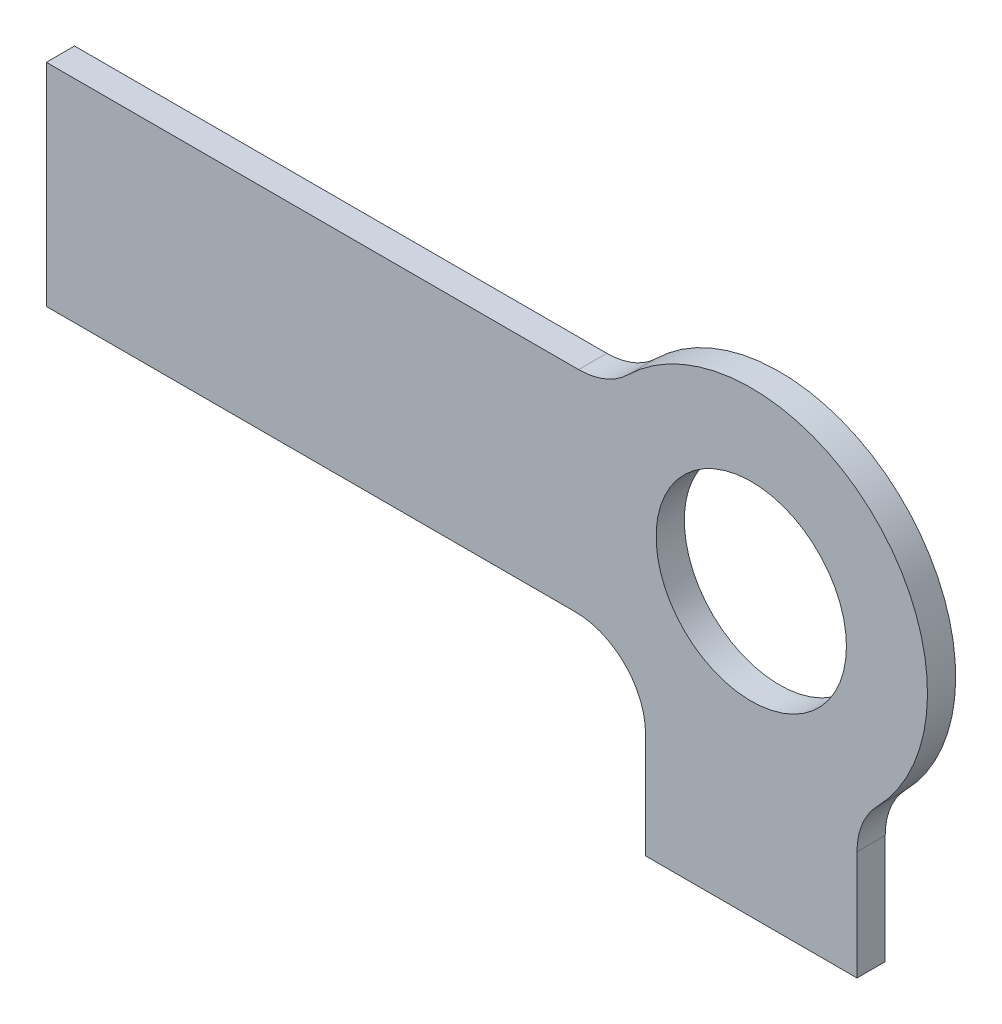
ISO-10303-21;
HEADER;
FILE_DESCRIPTION(('STEP AP214'),'2;1');
FILE_NAME('part.step','',(''),(''),'','','');
FILE_SCHEMA(('AUTOMOTIVE_DESIGN { 1 0 10303 214 1 1 1 1 }'));
ENDSEC;
DATA;
#1=APPLICATION_CONTEXT('core data for automotive mechanical design processes');
#2=APPLICATION_PROTOCOL_DEFINITION('international standard','automotive_design',2000,#1);
#3=PRODUCT_CONTEXT('',#1,'mechanical');
#4=PRODUCT('Part','Part','',(#3));
#5=PRODUCT_RELATED_PRODUCT_CATEGORY('part','',(#4));
#6=PRODUCT_DEFINITION_FORMATION('','',#4);
#7=PRODUCT_DEFINITION_CONTEXT('part definition',#1,'design');
#8=PRODUCT_DEFINITION('design','',#6,#7);
#9=PRODUCT_DEFINITION_SHAPE('','',#8);
#10=(LENGTH_UNIT() NAMED_UNIT(*) SI_UNIT(.MILLI.,.METRE.));
#11=(NAMED_UNIT(*) PLANE_ANGLE_UNIT() SI_UNIT($,.RADIAN.));
#12=(NAMED_UNIT(*) SI_UNIT($,.STERADIAN.) SOLID_ANGLE_UNIT());
#13=UNCERTAINTY_MEASURE_WITH_UNIT(LENGTH_MEASURE(1.E-05),#10,'distance_accuracy_value','');
#14=(GEOMETRIC_REPRESENTATION_CONTEXT(3) GLOBAL_UNCERTAINTY_ASSIGNED_CONTEXT((#13)) GLOBAL_UNIT_ASSIGNED_CONTEXT((#10,
#11,#12)) REPRESENTATION_CONTEXT('',''));
#15=CARTESIAN_POINT('',(0.,0.,0.));
#16=DIRECTION('',(0.,0.,1.));
#17=DIRECTION('',(1.,0.,0.));
#18=AXIS2_PLACEMENT_3D('',#15,#16,#17);
#19=CARTESIAN_POINT('',(-2.44948974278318,2.5,-0.4));
#20=DIRECTION('',(0.,0.,1.));
#21=DIRECTION('',(1.,0.,0.));
#22=AXIS2_PLACEMENT_3D('',#19,#20,#21);
#23=CYLINDRICAL_SURFACE('',#22,1.);
#24=CARTESIAN_POINT('',(-2.44948974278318,2.5,0.));
#25=DIRECTION('',(0.,0.,-1.));
#26=DIRECTION('',(1.,0.,0.));
#27=AXIS2_PLACEMENT_3D('',#24,#25,#26);
#28=CIRCLE('',#27,1.);
#29=CARTESIAN_POINT('',(-1.74963553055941,1.78571428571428,0.));
#30=VERTEX_POINT('',#29);
#31=CARTESIAN_POINT('',(-2.44948974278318,1.5,0.));
#32=VERTEX_POINT('',#31);
#33=EDGE_CURVE('E149',#30,#32,#28,.T.);
#34=ORIENTED_EDGE('',*,*,#33,.F.);
#35=DIRECTION('',(0.,0.,1.));
#36=VECTOR('',#35,1.);
#37=CARTESIAN_POINT('',(-1.74963553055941,1.78571428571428,-0.4));
#38=LINE('',#37,#36);
#39=CARTESIAN_POINT('',(-1.74963553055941,1.78571428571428,-0.4));
#40=VERTEX_POINT('',#39);
#41=EDGE_CURVE('E11',#40,#30,#38,.T.);
#42=ORIENTED_EDGE('',*,*,#41,.F.);
#43=CARTESIAN_POINT('',(-2.44948974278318,2.5,-0.4));
#44=DIRECTION('',(0.,0.,-1.));
#45=DIRECTION('',(1.,0.,0.));
#46=AXIS2_PLACEMENT_3D('',#43,#44,#45);
#47=CIRCLE('',#46,1.);
#48=CARTESIAN_POINT('',(-2.44948974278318,1.5,-0.4));
#49=VERTEX_POINT('',#48);
#50=EDGE_CURVE('E174',#40,#49,#47,.T.);
#51=ORIENTED_EDGE('',*,*,#50,.T.);
#52=DIRECTION('',(0.,0.,1.));
#53=VECTOR('',#52,1.);
#54=CARTESIAN_POINT('',(-2.44948974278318,1.5,-0.4));
#55=LINE('',#54,#53);
#56=EDGE_CURVE('E45',#49,#32,#55,.T.);
#57=ORIENTED_EDGE('',*,*,#56,.T.);
#58=EDGE_LOOP('',(#34,#42,#51,#57));
#59=FACE_BOUND('',#58,.T.);
#60=ADVANCED_FACE('F39',(#59),#23,.F.);
#61=CARTESIAN_POINT('',(0.,0.,-0.4));
#62=DIRECTION('',(0.,0.,1.));
#63=DIRECTION('',(1.,0.,0.));
#64=AXIS2_PLACEMENT_3D('',#61,#62,#63);
#65=CYLINDRICAL_SURFACE('',#64,2.5);
#66=CARTESIAN_POINT('',(0.,0.,0.));
#67=DIRECTION('',(0.,0.,1.));
#68=DIRECTION('',(1.,0.,0.));
#69=AXIS2_PLACEMENT_3D('',#66,#67,#68);
#70=CIRCLE('',#69,2.5);
#71=CARTESIAN_POINT('',(1.78571428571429,-1.74963553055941,0.));
#72=VERTEX_POINT('',#71);
#73=EDGE_CURVE('E173',#72,#30,#70,.T.);
#74=ORIENTED_EDGE('',*,*,#73,.F.);
#75=DIRECTION('',(0.,0.,1.));
#76=VECTOR('',#75,1.);
#77=CARTESIAN_POINT('',(1.78571428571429,-1.74963553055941,-0.4));
#78=LINE('',#77,#76);
#79=CARTESIAN_POINT('',(1.78571428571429,-1.74963553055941,-0.4));
#80=VERTEX_POINT('',#79);
#81=EDGE_CURVE('E48',#80,#72,#78,.T.);
#82=ORIENTED_EDGE('',*,*,#81,.F.);
#83=CARTESIAN_POINT('',(0.,0.,-0.4));
#84=DIRECTION('',(0.,0.,1.));
#85=DIRECTION('',(1.,0.,0.));
#86=AXIS2_PLACEMENT_3D('',#83,#84,#85);
#87=CIRCLE('',#86,2.5);
#88=EDGE_CURVE('E136',#80,#40,#87,.T.);
#89=ORIENTED_EDGE('',*,*,#88,.T.);
#90=ORIENTED_EDGE('',*,*,#41,.T.);
#91=EDGE_LOOP('',(#74,#82,#89,#90));
#92=FACE_BOUND('',#91,.T.);
#93=ADVANCED_FACE('F192',(#92),#65,.T.);
#94=CARTESIAN_POINT('',(2.5,-2.44948974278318,-0.4));
#95=DIRECTION('',(0.,0.,1.));
#96=DIRECTION('',(1.,0.,0.));
#97=AXIS2_PLACEMENT_3D('',#94,#95,#96);
#98=CYLINDRICAL_SURFACE('',#97,1.);
#99=CARTESIAN_POINT('',(2.5,-2.44948974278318,0.));
#100=DIRECTION('',(0.,0.,-1.));
#101=DIRECTION('',(1.,0.,0.));
#102=AXIS2_PLACEMENT_3D('',#99,#100,#101);
#103=CIRCLE('',#102,1.);
#104=CARTESIAN_POINT('',(1.5,-2.44948974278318,0.));
#105=VERTEX_POINT('',#104);
#106=EDGE_CURVE('E123',#105,#72,#103,.T.);
#107=ORIENTED_EDGE('',*,*,#106,.F.);
#108=DIRECTION('',(0.,0.,1.));
#109=VECTOR('',#108,1.);
#110=CARTESIAN_POINT('',(1.5,-2.44948974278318,-0.4));
#111=LINE('',#110,#109);
#112=CARTESIAN_POINT('',(1.5,-2.44948974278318,-0.4));
#113=VERTEX_POINT('',#112);
#114=EDGE_CURVE('E119',#113,#105,#111,.T.);
#115=ORIENTED_EDGE('',*,*,#114,.F.);
#116=CARTESIAN_POINT('',(2.5,-2.44948974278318,-0.4));
#117=DIRECTION('',(0.,0.,-1.));
#118=DIRECTION('',(1.,0.,0.));
#119=AXIS2_PLACEMENT_3D('',#116,#117,#118);
#120=CIRCLE('',#119,1.);
#121=EDGE_CURVE('E124',#113,#80,#120,.T.);
#122=ORIENTED_EDGE('',*,*,#121,.T.);
#123=ORIENTED_EDGE('',*,*,#81,.T.);
#124=EDGE_LOOP('',(#107,#115,#122,#123));
#125=FACE_BOUND('',#124,.T.);
#126=ADVANCED_FACE('F125',(#125),#98,.F.);
#127=CARTESIAN_POINT('',(1.5,-4.,-0.4));
#128=DIRECTION('',(1.,0.,0.));
#129=DIRECTION('',(0.,0.,-1.));
#130=AXIS2_PLACEMENT_3D('',#127,#128,#129);
#131=PLANE('',#130);
#132=DIRECTION('',(0.,1.,0.));
#133=VECTOR('',#132,1.);
#134=CARTESIAN_POINT('',(1.5,-4.,0.));
#135=LINE('',#134,#133);
#136=CARTESIAN_POINT('',(1.5,-4.,0.));
#137=VERTEX_POINT('',#136);
#138=EDGE_CURVE('E167',#137,#105,#135,.T.);
#139=ORIENTED_EDGE('',*,*,#138,.F.);
#140=DIRECTION('',(0.,0.,1.));
#141=VECTOR('',#140,1.);
#142=CARTESIAN_POINT('',(1.5,-4.,-0.4));
#143=LINE('',#142,#141);
#144=CARTESIAN_POINT('',(1.5,-4.,-0.4));
#145=VERTEX_POINT('',#144);
#146=EDGE_CURVE('E128',#145,#137,#143,.T.);
#147=ORIENTED_EDGE('',*,*,#146,.F.);
#148=DIRECTION('',(0.,1.,0.));
#149=VECTOR('',#148,1.);
#150=CARTESIAN_POINT('',(1.5,-4.,-0.4));
#151=LINE('',#150,#149);
#152=EDGE_CURVE('E138',#145,#113,#151,.T.);
#153=ORIENTED_EDGE('',*,*,#152,.T.);
#154=ORIENTED_EDGE('',*,*,#114,.T.);
#155=EDGE_LOOP('',(#139,#147,#153,#154));
#156=FACE_BOUND('',#155,.T.);
#157=ADVANCED_FACE('F137',(#156),#131,.T.);
#158=CARTESIAN_POINT('',(-1.5,-4.,-0.4));
#159=DIRECTION('',(0.,-1.,0.));
#160=DIRECTION('',(0.,0.,-1.));
#161=AXIS2_PLACEMENT_3D('',#158,#159,#160);
#162=PLANE('',#161);
#163=DIRECTION('',(1.,0.,0.));
#164=VECTOR('',#163,1.);
#165=CARTESIAN_POINT('',(-1.5,-4.,0.));
#166=LINE('',#165,#164);
#167=CARTESIAN_POINT('',(-1.5,-4.,0.));
#168=VERTEX_POINT('',#167);
#169=EDGE_CURVE('E170',#168,#137,#166,.T.);
#170=ORIENTED_EDGE('',*,*,#169,.F.);
#171=DIRECTION('',(0.,0.,1.));
#172=VECTOR('',#171,1.);
#173=CARTESIAN_POINT('',(-1.5,-4.,-0.4));
#174=LINE('',#173,#172);
#175=CARTESIAN_POINT('',(-1.5,-4.,-0.4));
#176=VERTEX_POINT('',#175);
#177=EDGE_CURVE('E177',#176,#168,#174,.T.);
#178=ORIENTED_EDGE('',*,*,#177,.F.);
#179=DIRECTION('',(1.,0.,0.));
#180=VECTOR('',#179,1.);
#181=CARTESIAN_POINT('',(-1.5,-4.,-0.4));
#182=LINE('',#181,#180);
#183=EDGE_CURVE('E142',#176,#145,#182,.T.);
#184=ORIENTED_EDGE('',*,*,#183,.T.);
#185=ORIENTED_EDGE('',*,*,#146,.T.);
#186=EDGE_LOOP('',(#170,#178,#184,#185));
#187=FACE_BOUND('',#186,.T.);
#188=ADVANCED_FACE('F204',(#187),#162,.T.);
#189=CARTESIAN_POINT('',(-1.5,-2.5,-0.4));
#190=DIRECTION('',(-1.,0.,0.));
#191=DIRECTION('',(0.,-1.,0.));
#192=AXIS2_PLACEMENT_3D('',#189,#190,#191);
#193=PLANE('',#192);
#194=DIRECTION('',(0.,-1.,0.));
#195=VECTOR('',#194,1.);
#196=CARTESIAN_POINT('',(-1.5,-2.5,0.));
#197=LINE('',#196,#195);
#198=CARTESIAN_POINT('',(-1.5,-2.5,0.));
#199=VERTEX_POINT('',#198);
#200=EDGE_CURVE('E165',#199,#168,#197,.T.);
#201=ORIENTED_EDGE('',*,*,#200,.F.);
#202=DIRECTION('',(0.,0.,1.));
#203=VECTOR('',#202,1.);
#204=CARTESIAN_POINT('',(-1.5,-2.5,-0.4));
#205=LINE('',#204,#203);
#206=CARTESIAN_POINT('',(-1.5,-2.5,-0.4));
#207=VERTEX_POINT('',#206);
#208=EDGE_CURVE('E181',#207,#199,#205,.T.);
#209=ORIENTED_EDGE('',*,*,#208,.F.);
#210=DIRECTION('',(0.,-1.,0.));
#211=VECTOR('',#210,1.);
#212=CARTESIAN_POINT('',(-1.5,-2.5,-0.4));
#213=LINE('',#212,#211);
#214=EDGE_CURVE('E141',#207,#176,#213,.T.);
#215=ORIENTED_EDGE('',*,*,#214,.T.);
#216=ORIENTED_EDGE('',*,*,#177,.T.);
#217=EDGE_LOOP('',(#201,#209,#215,#216));
#218=FACE_BOUND('',#217,.T.);
#219=ADVANCED_FACE('F210',(#218),#193,.T.);
#220=CARTESIAN_POINT('',(-2.5,-2.5,-0.4));
#221=DIRECTION('',(0.,0.,1.));
#222=DIRECTION('',(1.,0.,0.));
#223=AXIS2_PLACEMENT_3D('',#220,#221,#222);
#224=CYLINDRICAL_SURFACE('',#223,1.);
#225=CARTESIAN_POINT('',(-2.5,-2.5,0.));
#226=DIRECTION('',(0.,0.,-1.));
#227=DIRECTION('',(1.,0.,0.));
#228=AXIS2_PLACEMENT_3D('',#225,#226,#227);
#229=CIRCLE('',#228,1.);
#230=CARTESIAN_POINT('',(-2.5,-1.5,0.));
#231=VERTEX_POINT('',#230);
#232=EDGE_CURVE('E163',#231,#199,#229,.T.);
#233=ORIENTED_EDGE('',*,*,#232,.F.);
#234=DIRECTION('',(0.,0.,1.));
#235=VECTOR('',#234,1.);
#236=CARTESIAN_POINT('',(-2.5,-1.5,-0.4));
#237=LINE('',#236,#235);
#238=CARTESIAN_POINT('',(-2.5,-1.5,-0.4));
#239=VERTEX_POINT('',#238);
#240=EDGE_CURVE('E182',#239,#231,#237,.T.);
#241=ORIENTED_EDGE('',*,*,#240,.F.);
#242=CARTESIAN_POINT('',(-2.5,-2.5,-0.4));
#243=DIRECTION('',(0.,0.,-1.));
#244=DIRECTION('',(1.,0.,0.));
#245=AXIS2_PLACEMENT_3D('',#242,#243,#244);
#246=CIRCLE('',#245,1.);
#247=EDGE_CURVE('E257',#239,#207,#246,.T.);
#248=ORIENTED_EDGE('',*,*,#247,.T.);
#249=ORIENTED_EDGE('',*,*,#208,.T.);
#250=EDGE_LOOP('',(#233,#241,#248,#249));
#251=FACE_BOUND('',#250,.T.);
#252=ADVANCED_FACE('F212',(#251),#224,.F.);
#253=CARTESIAN_POINT('',(-10.,-1.5,-0.4));
#254=DIRECTION('',(0.,-1.,0.));
#255=DIRECTION('',(1.,0.,0.));
#256=AXIS2_PLACEMENT_3D('',#253,#254,#255);
#257=PLANE('',#256);
#258=DIRECTION('',(1.,0.,0.));
#259=VECTOR('',#258,1.);
#260=CARTESIAN_POINT('',(-10.,-1.5,0.));
#261=LINE('',#260,#259);
#262=CARTESIAN_POINT('',(-10.,-1.5,0.));
#263=VERTEX_POINT('',#262);
#264=EDGE_CURVE('E156',#263,#231,#261,.T.);
#265=ORIENTED_EDGE('',*,*,#264,.F.);
#266=DIRECTION('',(0.,0.,1.));
#267=VECTOR('',#266,1.);
#268=CARTESIAN_POINT('',(-10.,-1.5,-0.4));
#269=LINE('',#268,#267);
#270=CARTESIAN_POINT('',(-10.,-1.5,-0.4));
#271=VERTEX_POINT('',#270);
#272=EDGE_CURVE('E184',#271,#263,#269,.T.);
#273=ORIENTED_EDGE('',*,*,#272,.F.);
#274=DIRECTION('',(1.,0.,0.));
#275=VECTOR('',#274,1.);
#276=CARTESIAN_POINT('',(-10.,-1.5,-0.4));
#277=LINE('',#276,#275);
#278=EDGE_CURVE('E254',#271,#239,#277,.T.);
#279=ORIENTED_EDGE('',*,*,#278,.T.);
#280=ORIENTED_EDGE('',*,*,#240,.T.);
#281=EDGE_LOOP('',(#265,#273,#279,#280));
#282=FACE_BOUND('',#281,.T.);
#283=ADVANCED_FACE('F213',(#282),#257,.T.);
#284=CARTESIAN_POINT('',(-10.,1.5,-0.4));
#285=DIRECTION('',(-1.,0.,0.));
#286=DIRECTION('',(0.,0.,1.));
#287=AXIS2_PLACEMENT_3D('',#284,#285,#286);
#288=PLANE('',#287);
#289=DIRECTION('',(0.,-1.,0.));
#290=VECTOR('',#289,1.);
#291=CARTESIAN_POINT('',(-10.,1.5,0.));
#292=LINE('',#291,#290);
#293=CARTESIAN_POINT('',(-10.,1.5,0.));
#294=VERTEX_POINT('',#293);
#295=EDGE_CURVE('E151',#294,#263,#292,.T.);
#296=ORIENTED_EDGE('',*,*,#295,.F.);
#297=DIRECTION('',(0.,0.,1.));
#298=VECTOR('',#297,1.);
#299=CARTESIAN_POINT('',(-10.,1.5,-0.4));
#300=LINE('',#299,#298);
#301=CARTESIAN_POINT('',(-10.,1.5,-0.4));
#302=VERTEX_POINT('',#301);
#303=EDGE_CURVE('E187',#302,#294,#300,.T.);
#304=ORIENTED_EDGE('',*,*,#303,.F.);
#305=DIRECTION('',(0.,-1.,0.));
#306=VECTOR('',#305,1.);
#307=CARTESIAN_POINT('',(-10.,1.5,-0.4));
#308=LINE('',#307,#306);
#309=EDGE_CURVE('E249',#302,#271,#308,.T.);
#310=ORIENTED_EDGE('',*,*,#309,.T.);
#311=ORIENTED_EDGE('',*,*,#272,.T.);
#312=EDGE_LOOP('',(#296,#304,#310,#311));
#313=FACE_BOUND('',#312,.T.);
#314=ADVANCED_FACE('F220',(#313),#288,.T.);
#315=CARTESIAN_POINT('',(-10.,1.5,-0.4));
#316=DIRECTION('',(0.,1.,0.));
#317=DIRECTION('',(0.,0.,1.));
#318=AXIS2_PLACEMENT_3D('',#315,#316,#317);
#319=PLANE('',#318);
#320=DIRECTION('',(-1.,0.,0.));
#321=VECTOR('',#320,1.);
#322=CARTESIAN_POINT('',(-10.,1.5,0.));
#323=LINE('',#322,#321);
#324=EDGE_CURVE('E153',#32,#294,#323,.T.);
#325=ORIENTED_EDGE('',*,*,#324,.F.);
#326=ORIENTED_EDGE('',*,*,#56,.F.);
#327=DIRECTION('',(-1.,0.,0.));
#328=VECTOR('',#327,1.);
#329=CARTESIAN_POINT('',(-10.,1.5,-0.4));
#330=LINE('',#329,#328);
#331=EDGE_CURVE('E247',#49,#302,#330,.T.);
#332=ORIENTED_EDGE('',*,*,#331,.T.);
#333=ORIENTED_EDGE('',*,*,#303,.T.);
#334=EDGE_LOOP('',(#325,#326,#332,#333));
#335=FACE_BOUND('',#334,.T.);
#336=ADVANCED_FACE('F189',(#335),#319,.T.);
#337=CARTESIAN_POINT('',(-2.44948974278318,2.5,-0.4));
#338=DIRECTION('',(0.,0.,1.));
#339=DIRECTION('',(1.,0.,0.));
#340=AXIS2_PLACEMENT_3D('',#337,#338,#339);
#341=PLANE('',#340);
#342=CARTESIAN_POINT('',(0.,0.,-0.4));
#343=DIRECTION('',(0.,0.,1.));
#344=DIRECTION('',(1.,0.,0.));
#345=AXIS2_PLACEMENT_3D('',#342,#343,#344);
#346=CIRCLE('',#345,1.35);
#347=CARTESIAN_POINT('',(1.35,0.,-0.4));
#348=VERTEX_POINT('',#347);
#349=EDGE_CURVE('E154',#348,#348,#346,.T.);
#350=ORIENTED_EDGE('',*,*,#349,.T.);
#351=EDGE_LOOP('',(#350));
#352=FACE_BOUND('',#351,.T.);
#353=ORIENTED_EDGE('',*,*,#50,.F.);
#354=ORIENTED_EDGE('',*,*,#88,.F.);
#355=ORIENTED_EDGE('',*,*,#121,.F.);
#356=ORIENTED_EDGE('',*,*,#152,.F.);
#357=ORIENTED_EDGE('',*,*,#183,.F.);
#358=ORIENTED_EDGE('',*,*,#214,.F.);
#359=ORIENTED_EDGE('',*,*,#247,.F.);
#360=ORIENTED_EDGE('',*,*,#278,.F.);
#361=ORIENTED_EDGE('',*,*,#309,.F.);
#362=ORIENTED_EDGE('',*,*,#331,.F.);
#363=EDGE_LOOP('',(#353,#354,#355,#356,#357,#358,#359,#360,#361,#362));
#364=FACE_BOUND('',#363,.T.);
#365=ADVANCED_FACE('F135',(#352,#364),#341,.F.);
#366=CARTESIAN_POINT('',(-2.44948974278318,2.5,0.));
#367=DIRECTION('',(0.,0.,1.));
#368=DIRECTION('',(1.,0.,0.));
#369=AXIS2_PLACEMENT_3D('',#366,#367,#368);
#370=PLANE('',#369);
#371=CARTESIAN_POINT('',(0.,0.,0.));
#372=DIRECTION('',(0.,0.,1.));
#373=DIRECTION('',(1.,0.,0.));
#374=AXIS2_PLACEMENT_3D('',#371,#372,#373);
#375=CIRCLE('',#374,1.35);
#376=CARTESIAN_POINT('',(1.35,0.,0.));
#377=VERTEX_POINT('',#376);
#378=EDGE_CURVE('E243',#377,#377,#375,.T.);
#379=ORIENTED_EDGE('',*,*,#378,.F.);
#380=EDGE_LOOP('',(#379));
#381=FACE_BOUND('',#380,.T.);
#382=ORIENTED_EDGE('',*,*,#33,.T.);
#383=ORIENTED_EDGE('',*,*,#324,.T.);
#384=ORIENTED_EDGE('',*,*,#295,.T.);
#385=ORIENTED_EDGE('',*,*,#264,.T.);
#386=ORIENTED_EDGE('',*,*,#232,.T.);
#387=ORIENTED_EDGE('',*,*,#200,.T.);
#388=ORIENTED_EDGE('',*,*,#169,.T.);
#389=ORIENTED_EDGE('',*,*,#138,.T.);
#390=ORIENTED_EDGE('',*,*,#106,.T.);
#391=ORIENTED_EDGE('',*,*,#73,.T.);
#392=EDGE_LOOP('',(#382,#383,#384,#385,#386,#387,#388,#389,#390,#391));
#393=FACE_BOUND('',#392,.T.);
#394=ADVANCED_FACE('F188',(#381,#393),#370,.T.);
#395=CARTESIAN_POINT('',(0.,0.,-0.4));
#396=DIRECTION('',(0.,0.,1.));
#397=DIRECTION('',(1.,0.,0.));
#398=AXIS2_PLACEMENT_3D('',#395,#396,#397);
#399=CYLINDRICAL_SURFACE('',#398,1.35);
#400=ORIENTED_EDGE('',*,*,#349,.F.);
#401=EDGE_LOOP('',(#400));
#402=FACE_BOUND('',#401,.T.);
#403=ORIENTED_EDGE('',*,*,#378,.T.);
#404=EDGE_LOOP('',(#403));
#405=FACE_BOUND('',#404,.T.);
#406=ADVANCED_FACE('F233',(#402,#405),#399,.F.);
#407=CLOSED_SHELL('',(#60,#93,#126,#157,#188,#219,#252,#283,#314,#336,#365,#394,#406));
#408=MANIFOLD_SOLID_BREP('B2',#407);
#409=ADVANCED_BREP_SHAPE_REPRESENTATION('',(#18,#408),#14);
#410=SHAPE_DEFINITION_REPRESENTATION(#9,#409);
ENDSEC;
END-ISO-10303-21;
